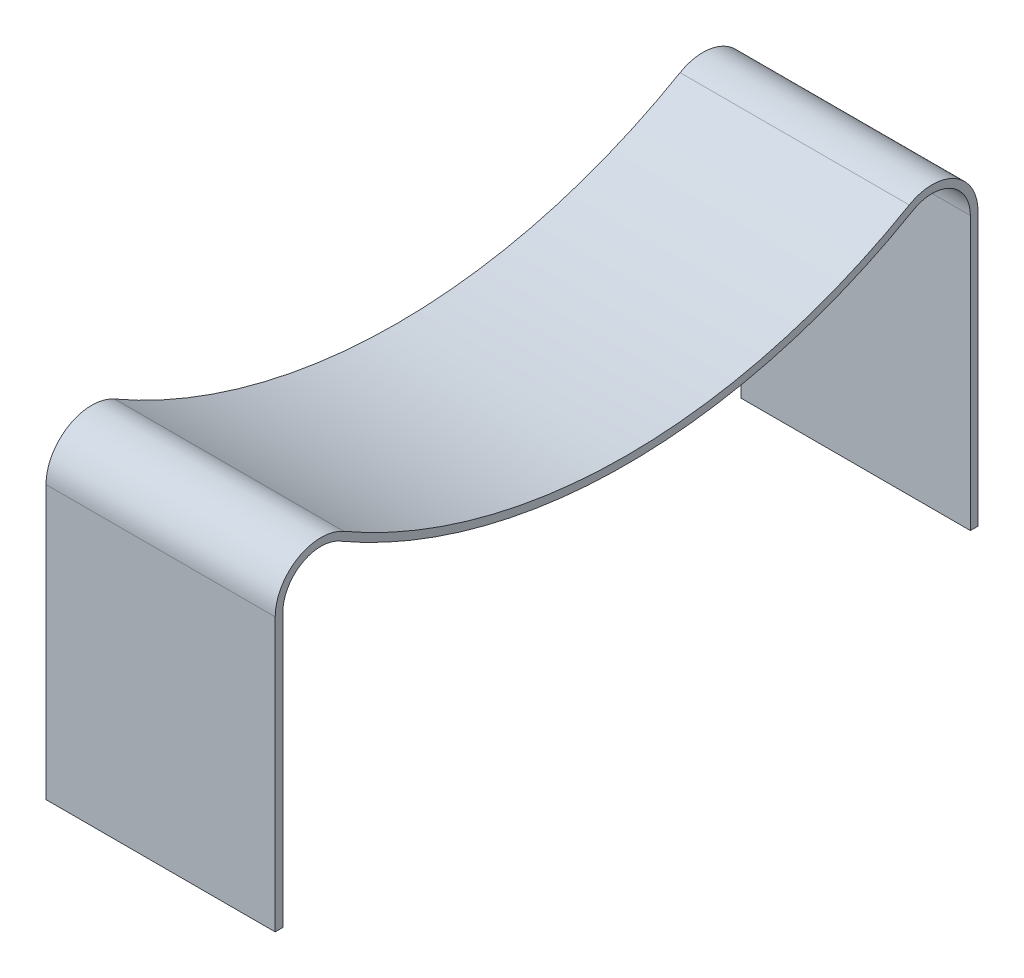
ISO-10303-21;
HEADER;
FILE_DESCRIPTION(('STEP AP214'),'2;1');
FILE_NAME('part.step','',(''),(''),'','','');
FILE_SCHEMA(('AUTOMOTIVE_DESIGN { 1 0 10303 214 1 1 1 1 }'));
ENDSEC;
DATA;
#1=APPLICATION_CONTEXT('core data for automotive mechanical design processes');
#2=APPLICATION_PROTOCOL_DEFINITION('international standard','automotive_design',2000,#1);
#3=PRODUCT_CONTEXT('',#1,'mechanical');
#4=PRODUCT('Part','Part','',(#3));
#5=PRODUCT_RELATED_PRODUCT_CATEGORY('part','',(#4));
#6=PRODUCT_DEFINITION_FORMATION('','',#4);
#7=PRODUCT_DEFINITION_CONTEXT('part definition',#1,'design');
#8=PRODUCT_DEFINITION('design','',#6,#7);
#9=PRODUCT_DEFINITION_SHAPE('','',#8);
#10=(LENGTH_UNIT() NAMED_UNIT(*) SI_UNIT(.MILLI.,.METRE.));
#11=(NAMED_UNIT(*) PLANE_ANGLE_UNIT() SI_UNIT($,.RADIAN.));
#12=(NAMED_UNIT(*) SI_UNIT($,.STERADIAN.) SOLID_ANGLE_UNIT());
#13=UNCERTAINTY_MEASURE_WITH_UNIT(LENGTH_MEASURE(1.E-05),#10,'distance_accuracy_value','');
#14=(GEOMETRIC_REPRESENTATION_CONTEXT(3) GLOBAL_UNCERTAINTY_ASSIGNED_CONTEXT((#13)) GLOBAL_UNIT_ASSIGNED_CONTEXT((#10,
#11,#12)) REPRESENTATION_CONTEXT('',''));
#15=CARTESIAN_POINT('',(0.,0.,0.));
#16=DIRECTION('',(0.,0.,1.));
#17=DIRECTION('',(1.,0.,0.));
#18=AXIS2_PLACEMENT_3D('',#15,#16,#17);
#19=CARTESIAN_POINT('',(3.,0.,9.00000000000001));
#20=DIRECTION('',(0.,1.,0.));
#21=DIRECTION('',(0.,0.,1.));
#22=AXIS2_PLACEMENT_3D('',#19,#20,#21);
#23=PLANE('',#22);
#24=DIRECTION('',(-1.,0.,0.));
#25=VECTOR('',#24,1.);
#26=CARTESIAN_POINT('',(3.,0.,9.20000000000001));
#27=LINE('',#26,#25);
#28=CARTESIAN_POINT('',(3.,0.,9.20000000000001));
#29=VERTEX_POINT('',#28);
#30=CARTESIAN_POINT('',(-3.,0.,9.20000000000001));
#31=VERTEX_POINT('',#30);
#32=EDGE_CURVE('E137',#29,#31,#27,.T.);
#33=ORIENTED_EDGE('',*,*,#32,.T.);
#34=DIRECTION('',(0.,0.,-1.));
#35=VECTOR('',#34,1.);
#36=CARTESIAN_POINT('',(-3.,0.,9.00000000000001));
#37=LINE('',#36,#35);
#38=CARTESIAN_POINT('',(-3.,0.,9.00000000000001));
#39=VERTEX_POINT('',#38);
#40=EDGE_CURVE('E131',#31,#39,#37,.T.);
#41=ORIENTED_EDGE('',*,*,#40,.T.);
#42=DIRECTION('',(-1.,0.,0.));
#43=VECTOR('',#42,1.);
#44=CARTESIAN_POINT('',(3.,0.,9.00000000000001));
#45=LINE('',#44,#43);
#46=CARTESIAN_POINT('',(3.,0.,9.00000000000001));
#47=VERTEX_POINT('',#46);
#48=EDGE_CURVE('E11',#47,#39,#45,.T.);
#49=ORIENTED_EDGE('',*,*,#48,.F.);
#50=DIRECTION('',(0.,0.,-1.));
#51=VECTOR('',#50,1.);
#52=CARTESIAN_POINT('',(3.,0.,9.00000000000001));
#53=LINE('',#52,#51);
#54=EDGE_CURVE('E167',#29,#47,#53,.T.);
#55=ORIENTED_EDGE('',*,*,#54,.F.);
#56=EDGE_LOOP('',(#33,#41,#49,#55));
#57=FACE_BOUND('',#56,.T.);
#58=ADVANCED_FACE('F31',(#57),#23,.F.);
#59=CARTESIAN_POINT('',(3.,0.,9.00000000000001));
#60=DIRECTION('',(0.,0.,1.));
#61=DIRECTION('',(1.,0.,0.));
#62=AXIS2_PLACEMENT_3D('',#59,#60,#61);
#63=PLANE('',#62);
#64=ORIENTED_EDGE('',*,*,#48,.T.);
#65=DIRECTION('',(0.,1.,0.));
#66=VECTOR('',#65,1.);
#67=CARTESIAN_POINT('',(-3.,0.,9.00000000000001));
#68=LINE('',#67,#66);
#69=CARTESIAN_POINT('',(-3.,7.14359353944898,9.00000000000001));
#70=VERTEX_POINT('',#69);
#71=EDGE_CURVE('E121',#39,#70,#68,.T.);
#72=ORIENTED_EDGE('',*,*,#71,.T.);
#73=DIRECTION('',(-1.,0.,0.));
#74=VECTOR('',#73,1.);
#75=CARTESIAN_POINT('',(3.,7.14359353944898,9.00000000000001));
#76=LINE('',#75,#74);
#77=CARTESIAN_POINT('',(3.,7.14359353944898,9.00000000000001));
#78=VERTEX_POINT('',#77);
#79=EDGE_CURVE('E38',#78,#70,#76,.T.);
#80=ORIENTED_EDGE('',*,*,#79,.F.);
#81=DIRECTION('',(0.,1.,0.));
#82=VECTOR('',#81,1.);
#83=CARTESIAN_POINT('',(3.,0.,9.00000000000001));
#84=LINE('',#83,#82);
#85=EDGE_CURVE('E122',#47,#78,#84,.T.);
#86=ORIENTED_EDGE('',*,*,#85,.F.);
#87=EDGE_LOOP('',(#64,#72,#80,#86));
#88=FACE_BOUND('',#87,.T.);
#89=ADVANCED_FACE('F119',(#88),#63,.F.);
#90=CARTESIAN_POINT('',(3.,7.14359353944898,8.));
#91=DIRECTION('',(-1.,0.,0.));
#92=DIRECTION('',(0.,0.,1.));
#93=AXIS2_PLACEMENT_3D('',#90,#91,#92);
#94=CYLINDRICAL_SURFACE('',#93,1.);
#95=ORIENTED_EDGE('',*,*,#79,.T.);
#96=CARTESIAN_POINT('',(-3.,7.14359353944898,8.));
#97=DIRECTION('',(-1.,0.,0.));
#98=DIRECTION('',(0.,0.,-1.));
#99=AXIS2_PLACEMENT_3D('',#96,#97,#98);
#100=CIRCLE('',#99,1.);
#101=CARTESIAN_POINT('',(-3.,8.00961894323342,7.5));
#102=VERTEX_POINT('',#101);
#103=EDGE_CURVE('E135',#70,#102,#100,.T.);
#104=ORIENTED_EDGE('',*,*,#103,.T.);
#105=DIRECTION('',(-1.,0.,0.));
#106=VECTOR('',#105,1.);
#107=CARTESIAN_POINT('',(3.,8.00961894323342,7.5));
#108=LINE('',#107,#106);
#109=CARTESIAN_POINT('',(3.,8.00961894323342,7.5));
#110=VERTEX_POINT('',#109);
#111=EDGE_CURVE('E205',#110,#102,#108,.T.);
#112=ORIENTED_EDGE('',*,*,#111,.F.);
#113=CARTESIAN_POINT('',(3.,7.14359353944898,8.));
#114=DIRECTION('',(-1.,0.,0.));
#115=DIRECTION('',(0.,0.,-1.));
#116=AXIS2_PLACEMENT_3D('',#113,#114,#115);
#117=CIRCLE('',#116,1.);
#118=EDGE_CURVE('E170',#78,#110,#117,.T.);
#119=ORIENTED_EDGE('',*,*,#118,.F.);
#120=EDGE_LOOP('',(#95,#104,#112,#119));
#121=FACE_BOUND('',#120,.T.);
#122=ADVANCED_FACE('F208',(#121),#94,.F.);
#123=CARTESIAN_POINT('',(3.,21.,0.));
#124=DIRECTION('',(-1.,0.,0.));
#125=DIRECTION('',(0.,0.,1.));
#126=AXIS2_PLACEMENT_3D('',#123,#124,#125);
#127=CYLINDRICAL_SURFACE('',#126,15.);
#128=ORIENTED_EDGE('',*,*,#111,.T.);
#129=CARTESIAN_POINT('',(-3.,21.,0.));
#130=DIRECTION('',(1.,0.,0.));
#131=DIRECTION('',(0.,0.,-1.));
#132=AXIS2_PLACEMENT_3D('',#129,#130,#131);
#133=CIRCLE('',#132,15.);
#134=CARTESIAN_POINT('',(-3.,8.00961894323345,-7.5));
#135=VERTEX_POINT('',#134);
#136=EDGE_CURVE('E141',#102,#135,#133,.T.);
#137=ORIENTED_EDGE('',*,*,#136,.T.);
#138=DIRECTION('',(-1.,0.,0.));
#139=VECTOR('',#138,1.);
#140=CARTESIAN_POINT('',(3.,8.00961894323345,-7.5));
#141=LINE('',#140,#139);
#142=CARTESIAN_POINT('',(3.,8.00961894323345,-7.5));
#143=VERTEX_POINT('',#142);
#144=EDGE_CURVE('E203',#143,#135,#141,.T.);
#145=ORIENTED_EDGE('',*,*,#144,.F.);
#146=CARTESIAN_POINT('',(3.,21.,0.));
#147=DIRECTION('',(1.,0.,0.));
#148=DIRECTION('',(0.,0.,-1.));
#149=AXIS2_PLACEMENT_3D('',#146,#147,#148);
#150=CIRCLE('',#149,15.);
#151=EDGE_CURVE('E172',#110,#143,#150,.T.);
#152=ORIENTED_EDGE('',*,*,#151,.F.);
#153=EDGE_LOOP('',(#128,#137,#145,#152));
#154=FACE_BOUND('',#153,.T.);
#155=ADVANCED_FACE('F216',(#154),#127,.T.);
#156=CARTESIAN_POINT('',(3.,7.14359353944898,-8.));
#157=DIRECTION('',(-1.,0.,0.));
#158=DIRECTION('',(0.,0.,1.));
#159=AXIS2_PLACEMENT_3D('',#156,#157,#158);
#160=CYLINDRICAL_SURFACE('',#159,1.);
#161=ORIENTED_EDGE('',*,*,#144,.T.);
#162=CARTESIAN_POINT('',(-3.,7.14359353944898,-8.));
#163=DIRECTION('',(-1.,0.,0.));
#164=DIRECTION('',(0.,0.,1.));
#165=AXIS2_PLACEMENT_3D('',#162,#163,#164);
#166=CIRCLE('',#165,1.);
#167=CARTESIAN_POINT('',(-3.,7.14359353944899,-9.00000000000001));
#168=VERTEX_POINT('',#167);
#169=EDGE_CURVE('E144',#135,#168,#166,.T.);
#170=ORIENTED_EDGE('',*,*,#169,.T.);
#171=DIRECTION('',(-1.,0.,0.));
#172=VECTOR('',#171,1.);
#173=CARTESIAN_POINT('',(3.,7.14359353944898,-9.00000000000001));
#174=LINE('',#173,#172);
#175=CARTESIAN_POINT('',(3.,7.14359353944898,-9.00000000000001));
#176=VERTEX_POINT('',#175);
#177=EDGE_CURVE('E201',#176,#168,#174,.T.);
#178=ORIENTED_EDGE('',*,*,#177,.F.);
#179=CARTESIAN_POINT('',(3.,7.14359353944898,-8.));
#180=DIRECTION('',(-1.,0.,0.));
#181=DIRECTION('',(0.,0.,1.));
#182=AXIS2_PLACEMENT_3D('',#179,#180,#181);
#183=CIRCLE('',#182,1.);
#184=EDGE_CURVE('E174',#143,#176,#183,.T.);
#185=ORIENTED_EDGE('',*,*,#184,.F.);
#186=EDGE_LOOP('',(#161,#170,#178,#185));
#187=FACE_BOUND('',#186,.T.);
#188=ADVANCED_FACE('F219',(#187),#160,.F.);
#189=CARTESIAN_POINT('',(3.,0.,-9.00000000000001));
#190=DIRECTION('',(0.,0.,-1.));
#191=DIRECTION('',(-1.,0.,0.));
#192=AXIS2_PLACEMENT_3D('',#189,#190,#191);
#193=PLANE('',#192);
#194=ORIENTED_EDGE('',*,*,#177,.T.);
#195=DIRECTION('',(0.,-1.,0.));
#196=VECTOR('',#195,1.);
#197=CARTESIAN_POINT('',(-3.,0.,-9.00000000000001));
#198=LINE('',#197,#196);
#199=CARTESIAN_POINT('',(-3.,0.,-9.00000000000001));
#200=VERTEX_POINT('',#199);
#201=EDGE_CURVE('E147',#168,#200,#198,.T.);
#202=ORIENTED_EDGE('',*,*,#201,.T.);
#203=DIRECTION('',(-1.,0.,0.));
#204=VECTOR('',#203,1.);
#205=CARTESIAN_POINT('',(3.,0.,-9.00000000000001));
#206=LINE('',#205,#204);
#207=CARTESIAN_POINT('',(3.,0.,-9.00000000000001));
#208=VERTEX_POINT('',#207);
#209=EDGE_CURVE('E199',#208,#200,#206,.T.);
#210=ORIENTED_EDGE('',*,*,#209,.F.);
#211=DIRECTION('',(0.,-1.,0.));
#212=VECTOR('',#211,1.);
#213=CARTESIAN_POINT('',(3.,0.,-9.00000000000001));
#214=LINE('',#213,#212);
#215=EDGE_CURVE('E176',#176,#208,#214,.T.);
#216=ORIENTED_EDGE('',*,*,#215,.F.);
#217=EDGE_LOOP('',(#194,#202,#210,#216));
#218=FACE_BOUND('',#217,.T.);
#219=ADVANCED_FACE('F224',(#218),#193,.F.);
#220=CARTESIAN_POINT('',(3.,0.,-9.00000000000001));
#221=DIRECTION('',(0.,1.,0.));
#222=DIRECTION('',(0.,0.,1.));
#223=AXIS2_PLACEMENT_3D('',#220,#221,#222);
#224=PLANE('',#223);
#225=ORIENTED_EDGE('',*,*,#209,.T.);
#226=DIRECTION('',(0.,0.,-1.));
#227=VECTOR('',#226,1.);
#228=CARTESIAN_POINT('',(-3.,0.,-9.00000000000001));
#229=LINE('',#228,#227);
#230=CARTESIAN_POINT('',(-3.,0.,-9.20000000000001));
#231=VERTEX_POINT('',#230);
#232=EDGE_CURVE('E150',#200,#231,#229,.T.);
#233=ORIENTED_EDGE('',*,*,#232,.T.);
#234=DIRECTION('',(-1.,0.,0.));
#235=VECTOR('',#234,1.);
#236=CARTESIAN_POINT('',(3.,0.,-9.20000000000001));
#237=LINE('',#236,#235);
#238=CARTESIAN_POINT('',(3.,0.,-9.20000000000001));
#239=VERTEX_POINT('',#238);
#240=EDGE_CURVE('E197',#239,#231,#237,.T.);
#241=ORIENTED_EDGE('',*,*,#240,.F.);
#242=DIRECTION('',(0.,0.,-1.));
#243=VECTOR('',#242,1.);
#244=CARTESIAN_POINT('',(3.,0.,-9.00000000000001));
#245=LINE('',#244,#243);
#246=EDGE_CURVE('E178',#208,#239,#245,.T.);
#247=ORIENTED_EDGE('',*,*,#246,.F.);
#248=EDGE_LOOP('',(#225,#233,#241,#247));
#249=FACE_BOUND('',#248,.T.);
#250=ADVANCED_FACE('F230',(#249),#224,.F.);
#251=CARTESIAN_POINT('',(3.,0.,-9.20000000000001));
#252=DIRECTION('',(0.,0.,1.));
#253=DIRECTION('',(1.,0.,0.));
#254=AXIS2_PLACEMENT_3D('',#251,#252,#253);
#255=PLANE('',#254);
#256=ORIENTED_EDGE('',*,*,#240,.T.);
#257=DIRECTION('',(0.,1.,0.));
#258=VECTOR('',#257,1.);
#259=CARTESIAN_POINT('',(-3.,0.,-9.20000000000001));
#260=LINE('',#259,#258);
#261=CARTESIAN_POINT('',(-3.,7.14359353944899,-9.20000000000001));
#262=VERTEX_POINT('',#261);
#263=EDGE_CURVE('E153',#231,#262,#260,.T.);
#264=ORIENTED_EDGE('',*,*,#263,.T.);
#265=DIRECTION('',(-1.,0.,0.));
#266=VECTOR('',#265,1.);
#267=CARTESIAN_POINT('',(3.,7.14359353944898,-9.20000000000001));
#268=LINE('',#267,#266);
#269=CARTESIAN_POINT('',(3.,7.14359353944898,-9.20000000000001));
#270=VERTEX_POINT('',#269);
#271=EDGE_CURVE('E195',#270,#262,#268,.T.);
#272=ORIENTED_EDGE('',*,*,#271,.F.);
#273=DIRECTION('',(0.,1.,0.));
#274=VECTOR('',#273,1.);
#275=CARTESIAN_POINT('',(3.,0.,-9.20000000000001));
#276=LINE('',#275,#274);
#277=EDGE_CURVE('E180',#239,#270,#276,.T.);
#278=ORIENTED_EDGE('',*,*,#277,.F.);
#279=EDGE_LOOP('',(#256,#264,#272,#278));
#280=FACE_BOUND('',#279,.T.);
#281=ADVANCED_FACE('F234',(#280),#255,.F.);
#282=CARTESIAN_POINT('',(3.,7.14359353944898,-8.));
#283=DIRECTION('',(-1.,0.,0.));
#284=DIRECTION('',(0.,0.,1.));
#285=AXIS2_PLACEMENT_3D('',#282,#283,#284);
#286=CYLINDRICAL_SURFACE('',#285,1.2);
#287=ORIENTED_EDGE('',*,*,#271,.T.);
#288=CARTESIAN_POINT('',(-3.,7.14359353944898,-8.));
#289=DIRECTION('',(1.,0.,0.));
#290=DIRECTION('',(0.,0.,1.));
#291=AXIS2_PLACEMENT_3D('',#288,#289,#290);
#292=CIRCLE('',#291,1.2);
#293=CARTESIAN_POINT('',(-3.,8.18282402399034,-7.4));
#294=VERTEX_POINT('',#293);
#295=EDGE_CURVE('E156',#262,#294,#292,.T.);
#296=ORIENTED_EDGE('',*,*,#295,.T.);
#297=DIRECTION('',(-1.,0.,0.));
#298=VECTOR('',#297,1.);
#299=CARTESIAN_POINT('',(3.,8.18282402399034,-7.4));
#300=LINE('',#299,#298);
#301=CARTESIAN_POINT('',(3.,8.18282402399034,-7.4));
#302=VERTEX_POINT('',#301);
#303=EDGE_CURVE('E193',#302,#294,#300,.T.);
#304=ORIENTED_EDGE('',*,*,#303,.F.);
#305=CARTESIAN_POINT('',(3.,7.14359353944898,-8.));
#306=DIRECTION('',(1.,0.,0.));
#307=DIRECTION('',(0.,0.,1.));
#308=AXIS2_PLACEMENT_3D('',#305,#306,#307);
#309=CIRCLE('',#308,1.2);
#310=EDGE_CURVE('E182',#270,#302,#309,.T.);
#311=ORIENTED_EDGE('',*,*,#310,.F.);
#312=EDGE_LOOP('',(#287,#296,#304,#311));
#313=FACE_BOUND('',#312,.T.);
#314=ADVANCED_FACE('F239',(#313),#286,.T.);
#315=CARTESIAN_POINT('',(3.,21.,0.));
#316=DIRECTION('',(-1.,0.,0.));
#317=DIRECTION('',(0.,0.,1.));
#318=AXIS2_PLACEMENT_3D('',#315,#316,#317);
#319=CYLINDRICAL_SURFACE('',#318,14.8);
#320=ORIENTED_EDGE('',*,*,#303,.T.);
#321=CARTESIAN_POINT('',(-3.,21.,0.));
#322=DIRECTION('',(-1.,0.,0.));
#323=DIRECTION('',(0.,0.,-1.));
#324=AXIS2_PLACEMENT_3D('',#321,#322,#323);
#325=CIRCLE('',#324,14.8);
#326=CARTESIAN_POINT('',(-3.,8.1828240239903,7.4));
#327=VERTEX_POINT('',#326);
#328=EDGE_CURVE('E159',#294,#327,#325,.T.);
#329=ORIENTED_EDGE('',*,*,#328,.T.);
#330=DIRECTION('',(-1.,0.,0.));
#331=VECTOR('',#330,1.);
#332=CARTESIAN_POINT('',(3.,8.1828240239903,7.4));
#333=LINE('',#332,#331);
#334=CARTESIAN_POINT('',(3.,8.1828240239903,7.4));
#335=VERTEX_POINT('',#334);
#336=EDGE_CURVE('E191',#335,#327,#333,.T.);
#337=ORIENTED_EDGE('',*,*,#336,.F.);
#338=CARTESIAN_POINT('',(3.,21.,0.));
#339=DIRECTION('',(-1.,0.,0.));
#340=DIRECTION('',(0.,0.,-1.));
#341=AXIS2_PLACEMENT_3D('',#338,#339,#340);
#342=CIRCLE('',#341,14.8);
#343=EDGE_CURVE('E184',#302,#335,#342,.T.);
#344=ORIENTED_EDGE('',*,*,#343,.F.);
#345=EDGE_LOOP('',(#320,#329,#337,#344));
#346=FACE_BOUND('',#345,.T.);
#347=ADVANCED_FACE('F243',(#346),#319,.F.);
#348=CARTESIAN_POINT('',(3.,7.14359353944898,8.));
#349=DIRECTION('',(-1.,0.,0.));
#350=DIRECTION('',(0.,0.,1.));
#351=AXIS2_PLACEMENT_3D('',#348,#349,#350);
#352=CYLINDRICAL_SURFACE('',#351,1.2);
#353=ORIENTED_EDGE('',*,*,#336,.T.);
#354=CARTESIAN_POINT('',(-3.,7.14359353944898,8.));
#355=DIRECTION('',(1.,0.,0.));
#356=DIRECTION('',(0.,0.,-1.));
#357=AXIS2_PLACEMENT_3D('',#354,#355,#356);
#358=CIRCLE('',#357,1.2);
#359=CARTESIAN_POINT('',(-3.,7.14359353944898,9.2));
#360=VERTEX_POINT('',#359);
#361=EDGE_CURVE('E162',#327,#360,#358,.T.);
#362=ORIENTED_EDGE('',*,*,#361,.T.);
#363=DIRECTION('',(-1.,0.,0.));
#364=VECTOR('',#363,1.);
#365=CARTESIAN_POINT('',(3.,7.14359353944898,9.2));
#366=LINE('',#365,#364);
#367=CARTESIAN_POINT('',(3.,7.14359353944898,9.2));
#368=VERTEX_POINT('',#367);
#369=EDGE_CURVE('E189',#368,#360,#366,.T.);
#370=ORIENTED_EDGE('',*,*,#369,.F.);
#371=CARTESIAN_POINT('',(3.,7.14359353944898,8.));
#372=DIRECTION('',(1.,0.,0.));
#373=DIRECTION('',(0.,0.,-1.));
#374=AXIS2_PLACEMENT_3D('',#371,#372,#373);
#375=CIRCLE('',#374,1.2);
#376=EDGE_CURVE('E50',#335,#368,#375,.T.);
#377=ORIENTED_EDGE('',*,*,#376,.F.);
#378=EDGE_LOOP('',(#353,#362,#370,#377));
#379=FACE_BOUND('',#378,.T.);
#380=ADVANCED_FACE('F247',(#379),#352,.T.);
#381=CARTESIAN_POINT('',(3.,0.,9.20000000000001));
#382=DIRECTION('',(0.,0.,-1.));
#383=DIRECTION('',(-1.,0.,0.));
#384=AXIS2_PLACEMENT_3D('',#381,#382,#383);
#385=PLANE('',#384);
#386=ORIENTED_EDGE('',*,*,#369,.T.);
#387=DIRECTION('',(0.,-1.,0.));
#388=VECTOR('',#387,1.);
#389=CARTESIAN_POINT('',(-3.,0.,9.20000000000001));
#390=LINE('',#389,#388);
#391=EDGE_CURVE('E165',#360,#31,#390,.T.);
#392=ORIENTED_EDGE('',*,*,#391,.T.);
#393=ORIENTED_EDGE('',*,*,#32,.F.);
#394=DIRECTION('',(0.,-1.,0.));
#395=VECTOR('',#394,1.);
#396=CARTESIAN_POINT('',(3.,0.,9.20000000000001));
#397=LINE('',#396,#395);
#398=EDGE_CURVE('E45',#368,#29,#397,.T.);
#399=ORIENTED_EDGE('',*,*,#398,.F.);
#400=EDGE_LOOP('',(#386,#392,#393,#399));
#401=FACE_BOUND('',#400,.T.);
#402=ADVANCED_FACE('F249',(#401),#385,.F.);
#403=CARTESIAN_POINT('',(3.,7.14359353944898,8.));
#404=DIRECTION('',(1.,0.,0.));
#405=DIRECTION('',(0.,0.,-1.));
#406=AXIS2_PLACEMENT_3D('',#403,#404,#405);
#407=PLANE('',#406);
#408=ORIENTED_EDGE('',*,*,#54,.T.);
#409=ORIENTED_EDGE('',*,*,#85,.T.);
#410=ORIENTED_EDGE('',*,*,#118,.T.);
#411=ORIENTED_EDGE('',*,*,#151,.T.);
#412=ORIENTED_EDGE('',*,*,#184,.T.);
#413=ORIENTED_EDGE('',*,*,#215,.T.);
#414=ORIENTED_EDGE('',*,*,#246,.T.);
#415=ORIENTED_EDGE('',*,*,#277,.T.);
#416=ORIENTED_EDGE('',*,*,#310,.T.);
#417=ORIENTED_EDGE('',*,*,#343,.T.);
#418=ORIENTED_EDGE('',*,*,#376,.T.);
#419=ORIENTED_EDGE('',*,*,#398,.T.);
#420=EDGE_LOOP('',(#408,#409,#410,#411,#412,#413,#414,#415,#416,#417,#418,#419));
#421=FACE_BOUND('',#420,.T.);
#422=ADVANCED_FACE('F211',(#421),#407,.T.);
#423=CARTESIAN_POINT('',(-3.,7.14359353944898,8.));
#424=DIRECTION('',(1.,0.,0.));
#425=DIRECTION('',(0.,0.,-1.));
#426=AXIS2_PLACEMENT_3D('',#423,#424,#425);
#427=PLANE('',#426);
#428=ORIENTED_EDGE('',*,*,#40,.F.);
#429=ORIENTED_EDGE('',*,*,#391,.F.);
#430=ORIENTED_EDGE('',*,*,#361,.F.);
#431=ORIENTED_EDGE('',*,*,#328,.F.);
#432=ORIENTED_EDGE('',*,*,#295,.F.);
#433=ORIENTED_EDGE('',*,*,#263,.F.);
#434=ORIENTED_EDGE('',*,*,#232,.F.);
#435=ORIENTED_EDGE('',*,*,#201,.F.);
#436=ORIENTED_EDGE('',*,*,#169,.F.);
#437=ORIENTED_EDGE('',*,*,#136,.F.);
#438=ORIENTED_EDGE('',*,*,#103,.F.);
#439=ORIENTED_EDGE('',*,*,#71,.F.);
#440=EDGE_LOOP('',(#428,#429,#430,#431,#432,#433,#434,#435,#436,#437,#438,#439));
#441=FACE_BOUND('',#440,.T.);
#442=ADVANCED_FACE('F129',(#441),#427,.F.);
#443=CLOSED_SHELL('',(#58,#89,#122,#155,#188,#219,#250,#281,#314,#347,#380,#402,#422,#442));
#444=MANIFOLD_SOLID_BREP('B2',#443);
#445=ADVANCED_BREP_SHAPE_REPRESENTATION('',(#18,#444),#14);
#446=SHAPE_DEFINITION_REPRESENTATION(#9,#445);
ENDSEC;
END-ISO-10303-21;
